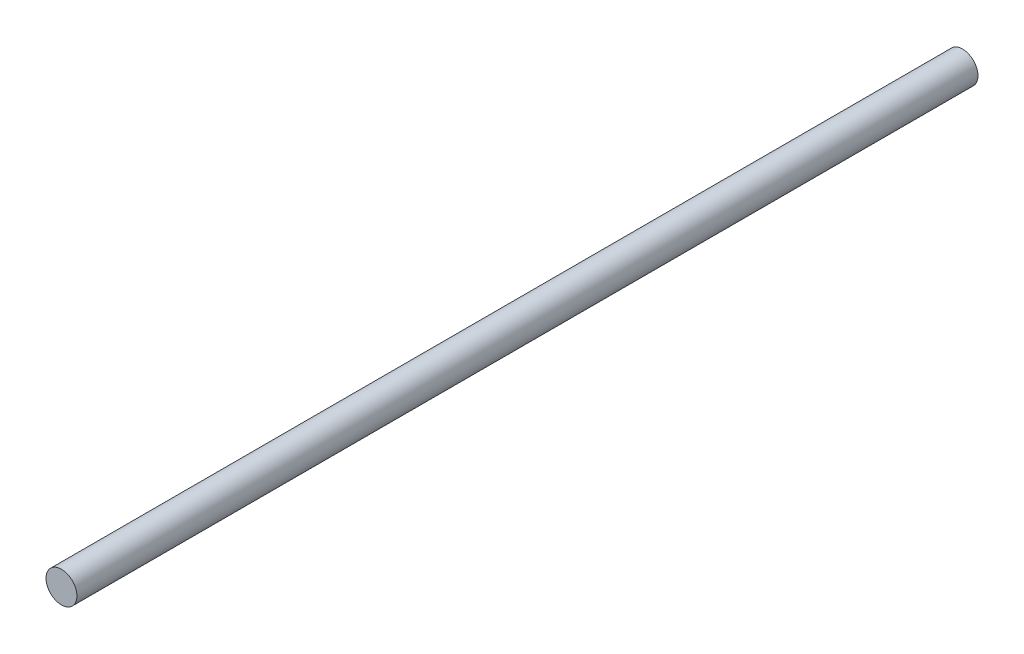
ISO-10303-21;
HEADER;
FILE_DESCRIPTION(('STEP AP214'),'2;1');
FILE_NAME('part.step','',(''),(''),'','','');
FILE_SCHEMA(('AUTOMOTIVE_DESIGN { 1 0 10303 214 1 1 1 1 }'));
ENDSEC;
DATA;
#1=APPLICATION_CONTEXT('core data for automotive mechanical design processes');
#2=APPLICATION_PROTOCOL_DEFINITION('international standard','automotive_design',2000,#1);
#3=PRODUCT_CONTEXT('',#1,'mechanical');
#4=PRODUCT('Part','Part','',(#3));
#5=PRODUCT_RELATED_PRODUCT_CATEGORY('part','',(#4));
#6=PRODUCT_DEFINITION_FORMATION('','',#4);
#7=PRODUCT_DEFINITION_CONTEXT('part definition',#1,'design');
#8=PRODUCT_DEFINITION('design','',#6,#7);
#9=PRODUCT_DEFINITION_SHAPE('','',#8);
#10=(LENGTH_UNIT() NAMED_UNIT(*) SI_UNIT(.MILLI.,.METRE.));
#11=(NAMED_UNIT(*) PLANE_ANGLE_UNIT() SI_UNIT($,.RADIAN.));
#12=(NAMED_UNIT(*) SI_UNIT($,.STERADIAN.) SOLID_ANGLE_UNIT());
#13=UNCERTAINTY_MEASURE_WITH_UNIT(LENGTH_MEASURE(1.E-05),#10,'distance_accuracy_value','');
#14=(GEOMETRIC_REPRESENTATION_CONTEXT(3) GLOBAL_UNCERTAINTY_ASSIGNED_CONTEXT((#13)) GLOBAL_UNIT_ASSIGNED_CONTEXT((#10,
#11,#12)) REPRESENTATION_CONTEXT('',''));
#15=CARTESIAN_POINT('',(0.,0.,0.));
#16=DIRECTION('',(0.,0.,1.));
#17=DIRECTION('',(1.,0.,0.));
#18=AXIS2_PLACEMENT_3D('',#15,#16,#17);
#19=CARTESIAN_POINT('',(0.,0.,46.6457530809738));
#20=DIRECTION('',(0.,0.,1.));
#21=DIRECTION('',(1.,0.,0.));
#22=AXIS2_PLACEMENT_3D('',#19,#20,#21);
#23=PLANE('',#22);
#24=CARTESIAN_POINT('',(0.,0.,46.6457530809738));
#25=DIRECTION('',(0.,0.,-1.));
#26=DIRECTION('',(-1.,0.,0.));
#27=AXIS2_PLACEMENT_3D('',#24,#25,#26);
#28=CIRCLE('',#27,1.6);
#29=CARTESIAN_POINT('',(-1.6,0.,46.6457530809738));
#30=VERTEX_POINT('',#29);
#31=EDGE_CURVE('E9',#30,#30,#28,.T.);
#32=ORIENTED_EDGE('',*,*,#31,.F.);
#33=EDGE_LOOP('',(#32));
#34=FACE_BOUND('',#33,.T.);
#35=ADVANCED_FACE('F14',(#34),#23,.T.);
#36=CARTESIAN_POINT('',(0.,0.,-46.6457530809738));
#37=DIRECTION('',(0.,0.,-1.));
#38=DIRECTION('',(-1.,0.,0.));
#39=AXIS2_PLACEMENT_3D('',#36,#37,#38);
#40=PLANE('',#39);
#41=CARTESIAN_POINT('',(0.,0.,-46.6457530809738));
#42=DIRECTION('',(0.,0.,1.));
#43=DIRECTION('',(1.,0.,0.));
#44=AXIS2_PLACEMENT_3D('',#41,#42,#43);
#45=CIRCLE('',#44,1.6);
#46=CARTESIAN_POINT('',(1.6,0.,-46.6457530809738));
#47=VERTEX_POINT('',#46);
#48=EDGE_CURVE('E21',#47,#47,#45,.T.);
#49=ORIENTED_EDGE('',*,*,#48,.F.);
#50=EDGE_LOOP('',(#49));
#51=FACE_BOUND('',#50,.T.);
#52=ADVANCED_FACE('F29',(#51),#40,.T.);
#53=CARTESIAN_POINT('',(0.,0.,-46.6457530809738));
#54=DIRECTION('',(0.,0.,1.));
#55=DIRECTION('',(1.,0.,0.));
#56=AXIS2_PLACEMENT_3D('',#53,#54,#55);
#57=CYLINDRICAL_SURFACE('',#56,1.6);
#58=ORIENTED_EDGE('',*,*,#31,.T.);
#59=EDGE_LOOP('',(#58));
#60=FACE_BOUND('',#59,.T.);
#61=ORIENTED_EDGE('',*,*,#48,.T.);
#62=EDGE_LOOP('',(#61));
#63=FACE_BOUND('',#62,.T.);
#64=ADVANCED_FACE('F16',(#60,#63),#57,.T.);
#65=CLOSED_SHELL('',(#35,#52,#64));
#66=MANIFOLD_SOLID_BREP('B1',#65);
#67=ADVANCED_BREP_SHAPE_REPRESENTATION('',(#18,#66),#14);
#68=SHAPE_DEFINITION_REPRESENTATION(#9,#67);
ENDSEC;
END-ISO-10303-21;
